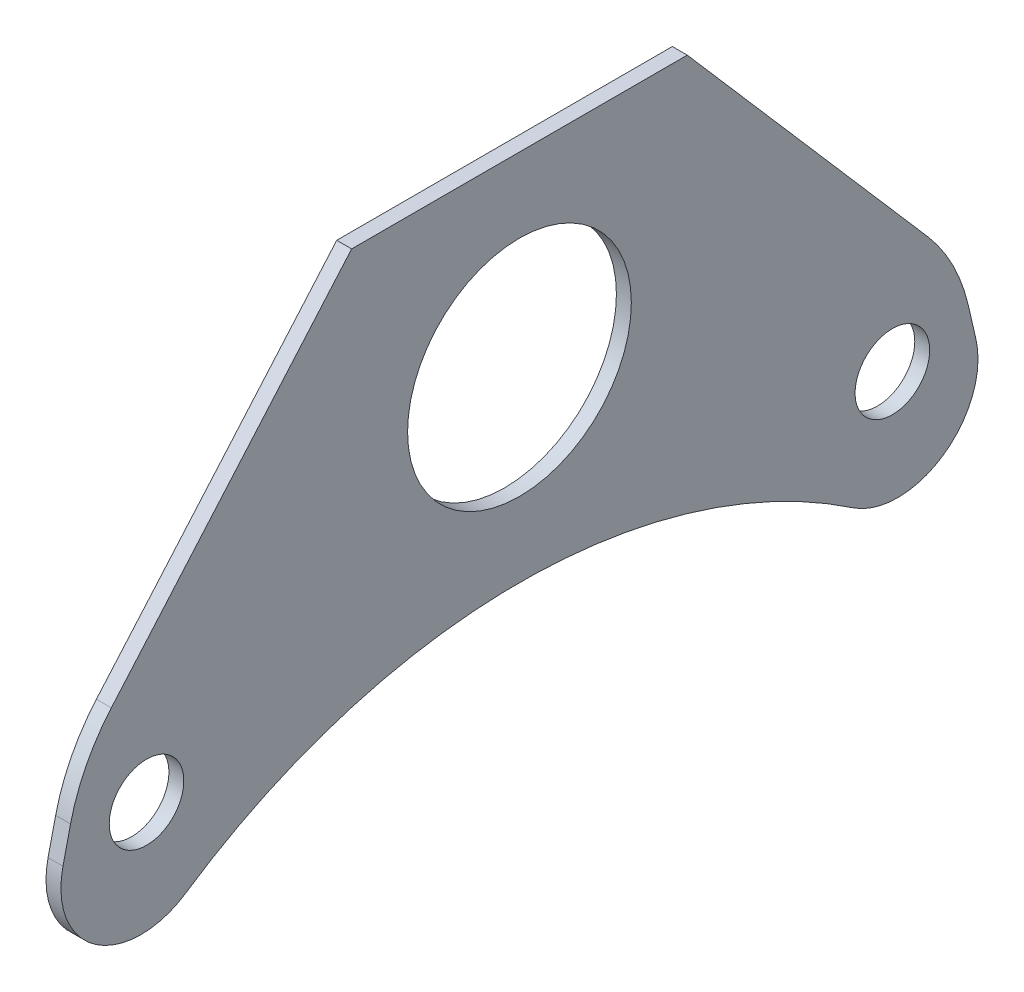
from build123d import *

# Parameters (mm, degrees)
ESQUISSE1_R             = 6
ESQUISSE1_R_2           = 2
BASE_EXTRUSION_DEPTH    = 0.8
ESQUISSE3_W             = 30
ESQUISSE3_H             = 30
ENL_V_MAT_EXTRU_1_DEPTH = 10


with BuildPart() as part:
    # Esquisse1 → Base-Extrusion (new body)
    with BuildSketch(Plane(origin=(0, 0, 0), x_dir=(0, 0, -1), z_dir=(1, 0, 0))):
        with BuildLine():
            Line((-24.074025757, -9.169694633), (-24.480803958, -10.931644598))
            ThreePointArc((-24.480803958, -10.931644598), (-22.72673585, -15.443224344), (-17.886217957, -15.465433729))
            ThreePointArc((-17.886217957, -15.465433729), (0, -10), (17.886217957, -15.465433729))
            ThreePointArc((17.886217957, -15.465433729), (22.72673585, -15.443224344), (24.480803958, -10.931644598))
            Line((24.480803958, -10.931644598), (24.074025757, -9.169694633))
            ThreePointArc((24.074025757, -9.169694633), (23.243782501, -6.885963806), (21.887223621, -4.869908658))
            Line((21.887223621, -4.869908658), (9, 10))
            Line((9, 10), (-9, 10))
            Line((-9, 10), (-21.887223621, -4.869908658))
            ThreePointArc((-21.887223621, -4.869908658), (-23.243782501, -6.885963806), (-24.074025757, -9.169694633))
        make_face()
        Circle(ESQUISSE1_R, mode=Mode.SUBTRACT)
        with Locations((20, -10.2)):
            Circle(ESQUISSE1_R_2, mode=Mode.SUBTRACT)
        with Locations(Location((-20, -10.2, 0), (0, 0, 180))):
            Circle(ESQUISSE1_R_2, mode=Mode.SUBTRACT)
    extrude(amount=BASE_EXTRUSION_DEPTH)

    # Esquisse3 → Enl_v. mat.-Extru.1 (cut)
    with BuildSketch(Plane(origin=(0, 0, 0), x_dir=(0, 0, -1), z_dir=(1, 0, 0))):
        with Locations((15, -5)):
            Rectangle(ESQUISSE3_W, ESQUISSE3_H)
    extrude(amount=-ENL_V_MAT_EXTRU_1_DEPTH, mode=Mode.SUBTRACT)


solid = part.part
